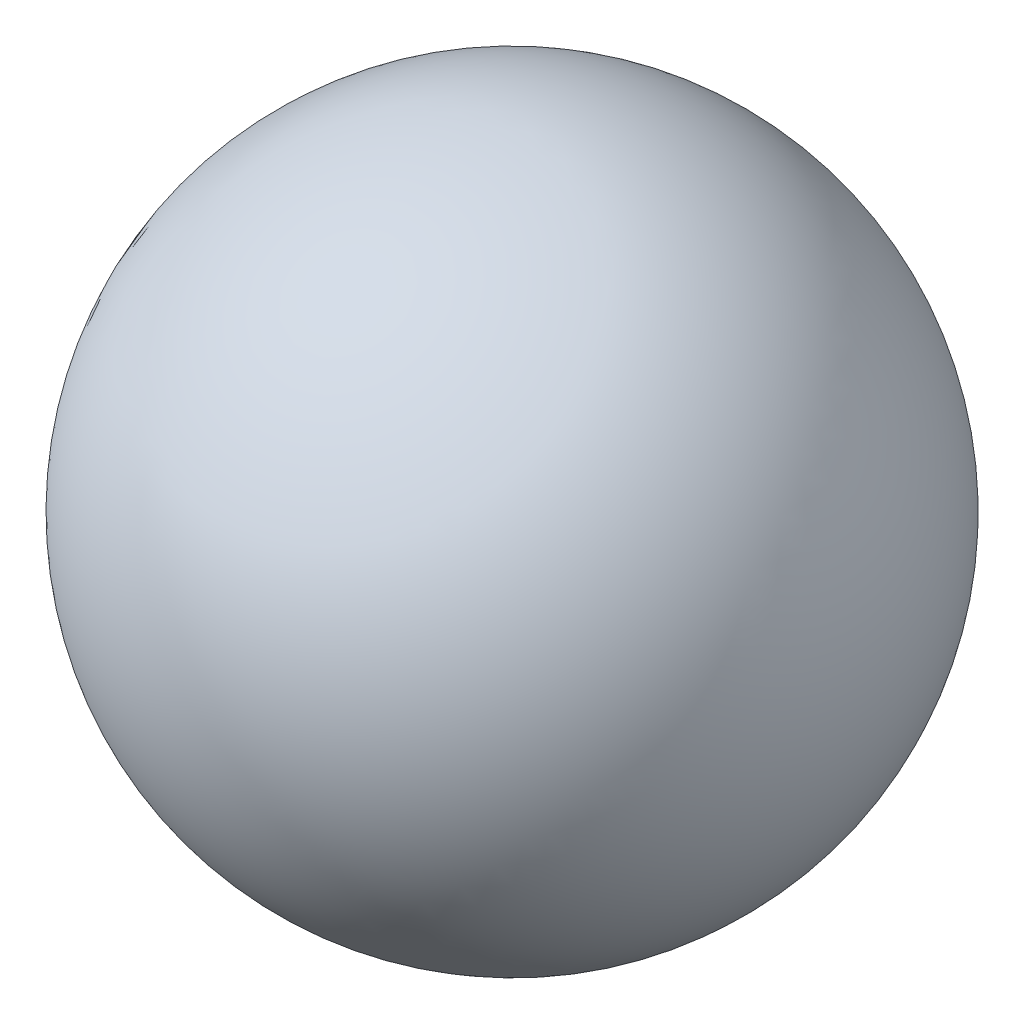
ISO-10303-21;
HEADER;
FILE_DESCRIPTION(('STEP AP214'),'2;1');
FILE_NAME('part.step','',(''),(''),'','','');
FILE_SCHEMA(('AUTOMOTIVE_DESIGN { 1 0 10303 214 1 1 1 1 }'));
ENDSEC;
DATA;
#1=APPLICATION_CONTEXT('core data for automotive mechanical design processes');
#2=APPLICATION_PROTOCOL_DEFINITION('international standard','automotive_design',2000,#1);
#3=PRODUCT_CONTEXT('',#1,'mechanical');
#4=PRODUCT('Part','Part','',(#3));
#5=PRODUCT_RELATED_PRODUCT_CATEGORY('part','',(#4));
#6=PRODUCT_DEFINITION_FORMATION('','',#4);
#7=PRODUCT_DEFINITION_CONTEXT('part definition',#1,'design');
#8=PRODUCT_DEFINITION('design','',#6,#7);
#9=PRODUCT_DEFINITION_SHAPE('','',#8);
#10=(LENGTH_UNIT() NAMED_UNIT(*) SI_UNIT(.MILLI.,.METRE.));
#11=(NAMED_UNIT(*) PLANE_ANGLE_UNIT() SI_UNIT($,.RADIAN.));
#12=(NAMED_UNIT(*) SI_UNIT($,.STERADIAN.) SOLID_ANGLE_UNIT());
#13=UNCERTAINTY_MEASURE_WITH_UNIT(LENGTH_MEASURE(1.E-05),#10,'distance_accuracy_value','');
#14=(GEOMETRIC_REPRESENTATION_CONTEXT(3) GLOBAL_UNCERTAINTY_ASSIGNED_CONTEXT((#13)) GLOBAL_UNIT_ASSIGNED_CONTEXT((#10,
#11,#12)) REPRESENTATION_CONTEXT('',''));
#15=CARTESIAN_POINT('',(0.,0.,0.));
#16=DIRECTION('',(0.,0.,1.));
#17=DIRECTION('',(1.,0.,0.));
#18=AXIS2_PLACEMENT_3D('',#15,#16,#17);
#19=CARTESIAN_POINT('',(4.5,10.75,0.));
#20=DIRECTION('',(0.51336002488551,0.522974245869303,0.68041121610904));
#21=DIRECTION('',(-0.853197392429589,0.39628695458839,0.339132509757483));
#22=AXIS2_PLACEMENT_3D('',#19,#20,#21);
#23=SPHERICAL_SURFACE('',#22,2.34);
#24=CARTESIAN_POINT('',(3.29873754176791,9.52624026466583,-1.59216224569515));
#25=VERTEX_POINT('',#24);
#26=VERTEX_LOOP('',#25);
#27=FACE_BOUND('',#26,.T.);
#28=CARTESIAN_POINT('',(5.70126245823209,11.9737597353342,1.59216224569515));
#29=VERTEX_POINT('',#28);
#30=VERTEX_LOOP('',#29);
#31=FACE_BOUND('',#30,.T.);
#32=ADVANCED_FACE('F16',(#27,#31),#23,.T.);
#33=CLOSED_SHELL('',(#32));
#34=MANIFOLD_SOLID_BREP('B1',#33);
#35=ADVANCED_BREP_SHAPE_REPRESENTATION('',(#18,#34),#14);
#36=SHAPE_DEFINITION_REPRESENTATION(#9,#35);
ENDSEC;
END-ISO-10303-21;
